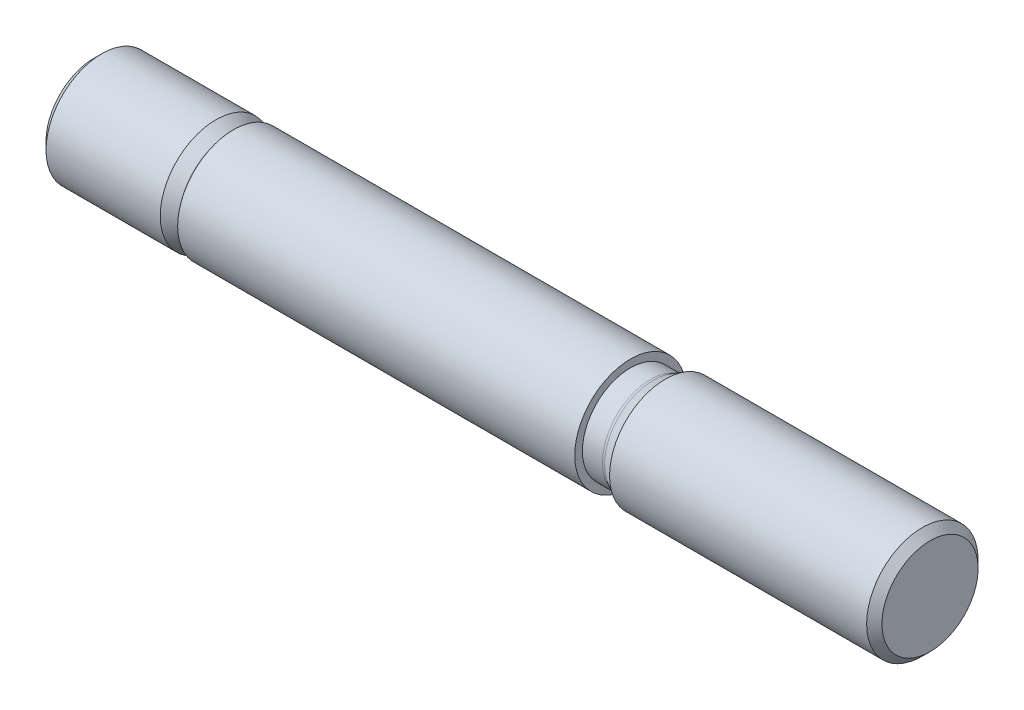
ISO-10303-21;
HEADER;
FILE_DESCRIPTION(('STEP AP214'),'2;1');
FILE_NAME('part.step','',(''),(''),'','','');
FILE_SCHEMA(('AUTOMOTIVE_DESIGN { 1 0 10303 214 1 1 1 1 }'));
ENDSEC;
DATA;
#1=APPLICATION_CONTEXT('core data for automotive mechanical design processes');
#2=APPLICATION_PROTOCOL_DEFINITION('international standard','automotive_design',2000,#1);
#3=PRODUCT_CONTEXT('',#1,'mechanical');
#4=PRODUCT('Part','Part','',(#3));
#5=PRODUCT_RELATED_PRODUCT_CATEGORY('part','',(#4));
#6=PRODUCT_DEFINITION_FORMATION('','',#4);
#7=PRODUCT_DEFINITION_CONTEXT('part definition',#1,'design');
#8=PRODUCT_DEFINITION('design','',#6,#7);
#9=PRODUCT_DEFINITION_SHAPE('','',#8);
#10=(LENGTH_UNIT() NAMED_UNIT(*) SI_UNIT(.MILLI.,.METRE.));
#11=(NAMED_UNIT(*) PLANE_ANGLE_UNIT() SI_UNIT($,.RADIAN.));
#12=(NAMED_UNIT(*) SI_UNIT($,.STERADIAN.) SOLID_ANGLE_UNIT());
#13=UNCERTAINTY_MEASURE_WITH_UNIT(LENGTH_MEASURE(1.E-05),#10,'distance_accuracy_value','');
#14=(GEOMETRIC_REPRESENTATION_CONTEXT(3) GLOBAL_UNCERTAINTY_ASSIGNED_CONTEXT((#13)) GLOBAL_UNIT_ASSIGNED_CONTEXT((#10,
#11,#12)) REPRESENTATION_CONTEXT('',''));
#15=CARTESIAN_POINT('',(0.,0.,0.));
#16=DIRECTION('',(0.,0.,1.));
#17=DIRECTION('',(1.,0.,0.));
#18=AXIS2_PLACEMENT_3D('',#15,#16,#17);
#19=CARTESIAN_POINT('',(0.,6.9,0.));
#20=DIRECTION('',(1.,0.,0.));
#21=DIRECTION('',(0.,0.,-1.));
#22=AXIS2_PLACEMENT_3D('',#19,#20,#21);
#23=PLANE('',#22);
#24=CARTESIAN_POINT('',(0.,0.,0.));
#25=DIRECTION('',(-1.,0.,0.));
#26=DIRECTION('',(0.,0.,1.));
#27=AXIS2_PLACEMENT_3D('',#24,#25,#26);
#28=CIRCLE('',#27,6.9);
#29=CARTESIAN_POINT('',(0.,0.,6.9));
#30=VERTEX_POINT('',#29);
#31=EDGE_CURVE('E85',#30,#30,#28,.T.);
#32=ORIENTED_EDGE('',*,*,#31,.T.);
#33=EDGE_LOOP('',(#32));
#34=FACE_BOUND('',#33,.T.);
#35=ADVANCED_FACE('F40',(#34),#23,.F.);
#36=CARTESIAN_POINT('',(120.,6.9,0.));
#37=DIRECTION('',(1.,0.,0.));
#38=DIRECTION('',(0.,0.,-1.));
#39=AXIS2_PLACEMENT_3D('',#36,#37,#38);
#40=PLANE('',#39);
#41=CARTESIAN_POINT('',(120.,0.,0.));
#42=DIRECTION('',(-1.,0.,0.));
#43=DIRECTION('',(0.,0.,1.));
#44=AXIS2_PLACEMENT_3D('',#41,#42,#43);
#45=CIRCLE('',#44,6.9);
#46=CARTESIAN_POINT('',(120.,0.,6.9));
#47=VERTEX_POINT('',#46);
#48=EDGE_CURVE('E10',#47,#47,#45,.T.);
#49=ORIENTED_EDGE('',*,*,#48,.F.);
#50=EDGE_LOOP('',(#49));
#51=FACE_BOUND('',#50,.T.);
#52=ADVANCED_FACE('F136',(#51),#40,.T.);
#53=CARTESIAN_POINT('',(118.9,0.,0.));
#54=DIRECTION('',(-1.,0.,0.));
#55=DIRECTION('',(0.,0.,1.));
#56=AXIS2_PLACEMENT_3D('',#53,#54,#55);
#57=CONICAL_SURFACE('',#56,8.,0.785398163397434);
#58=ORIENTED_EDGE('',*,*,#48,.T.);
#59=EDGE_LOOP('',(#58));
#60=FACE_BOUND('',#59,.T.);
#61=CARTESIAN_POINT('',(118.9,0.,0.));
#62=DIRECTION('',(-1.,0.,0.));
#63=DIRECTION('',(0.,0.,1.));
#64=AXIS2_PLACEMENT_3D('',#61,#62,#63);
#65=CIRCLE('',#64,8.);
#66=CARTESIAN_POINT('',(118.9,0.,8.));
#67=VERTEX_POINT('',#66);
#68=EDGE_CURVE('E43',#67,#67,#65,.T.);
#69=ORIENTED_EDGE('',*,*,#68,.F.);
#70=EDGE_LOOP('',(#69));
#71=FACE_BOUND('',#70,.T.);
#72=ADVANCED_FACE('F139',(#60,#71),#57,.T.);
#73=CARTESIAN_POINT('',(-3.175,0.,0.));
#74=DIRECTION('',(-1.,0.,0.));
#75=DIRECTION('',(0.,0.,1.));
#76=AXIS2_PLACEMENT_3D('',#73,#74,#75);
#77=CYLINDRICAL_SURFACE('',#76,8.);
#78=ORIENTED_EDGE('',*,*,#68,.T.);
#79=EDGE_LOOP('',(#78));
#80=FACE_BOUND('',#79,.T.);
#81=CARTESIAN_POINT('',(82.,0.,0.));
#82=DIRECTION('',(-1.,0.,0.));
#83=DIRECTION('',(0.,0.,1.));
#84=AXIS2_PLACEMENT_3D('',#81,#82,#83);
#85=CIRCLE('',#84,8.);
#86=CARTESIAN_POINT('',(82.,0.,8.));
#87=VERTEX_POINT('',#86);
#88=EDGE_CURVE('E50',#87,#87,#85,.T.);
#89=ORIENTED_EDGE('',*,*,#88,.F.);
#90=EDGE_LOOP('',(#89));
#91=FACE_BOUND('',#90,.T.);
#92=ADVANCED_FACE('F143',(#80,#91),#77,.T.);
#93=CARTESIAN_POINT('',(80.2803847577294,0.,0.));
#94=DIRECTION('',(1.,0.,0.));
#95=DIRECTION('',(0.,0.,-1.));
#96=AXIS2_PLACEMENT_3D('',#93,#94,#95);
#97=CONICAL_SURFACE('',#96,7.00717967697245,0.523598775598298);
#98=ORIENTED_EDGE('',*,*,#88,.T.);
#99=EDGE_LOOP('',(#98));
#100=FACE_BOUND('',#99,.T.);
#101=CARTESIAN_POINT('',(80.2803847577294,0.,0.));
#102=DIRECTION('',(-1.,0.,0.));
#103=DIRECTION('',(0.,0.,1.));
#104=AXIS2_PLACEMENT_3D('',#101,#102,#103);
#105=CIRCLE('',#104,7.00717967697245);
#106=CARTESIAN_POINT('',(80.2803847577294,0.,7.00717967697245));
#107=VERTEX_POINT('',#106);
#108=EDGE_CURVE('E51',#107,#107,#105,.T.);
#109=ORIENTED_EDGE('',*,*,#108,.F.);
#110=EDGE_LOOP('',(#109));
#111=FACE_BOUND('',#110,.T.);
#112=ADVANCED_FACE('F147',(#100,#111),#97,.T.);
#113=CARTESIAN_POINT('',(79.8803847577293,0.,0.));
#114=DIRECTION('',(-1.,0.,0.));
#115=DIRECTION('',(0.,0.,1.));
#116=AXIS2_PLACEMENT_3D('',#113,#114,#115);
#117=TOROIDAL_SURFACE('',#116,7.7,0.800000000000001);
#118=ORIENTED_EDGE('',*,*,#108,.T.);
#119=EDGE_LOOP('',(#118));
#120=FACE_BOUND('',#119,.T.);
#121=CARTESIAN_POINT('',(79.8803847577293,0.,0.));
#122=DIRECTION('',(-1.,0.,0.));
#123=DIRECTION('',(0.,0.,1.));
#124=AXIS2_PLACEMENT_3D('',#121,#122,#123);
#125=CIRCLE('',#124,6.9);
#126=CARTESIAN_POINT('',(79.8803847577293,0.,6.9));
#127=VERTEX_POINT('',#126);
#128=EDGE_CURVE('E57',#127,#127,#125,.T.);
#129=ORIENTED_EDGE('',*,*,#128,.F.);
#130=EDGE_LOOP('',(#129));
#131=FACE_BOUND('',#130,.T.);
#132=ADVANCED_FACE('F153',(#120,#131),#117,.F.);
#133=CARTESIAN_POINT('',(-3.175,0.,0.));
#134=DIRECTION('',(-1.,0.,0.));
#135=DIRECTION('',(0.,0.,1.));
#136=AXIS2_PLACEMENT_3D('',#133,#134,#135);
#137=CYLINDRICAL_SURFACE('',#136,6.9);
#138=ORIENTED_EDGE('',*,*,#128,.T.);
#139=EDGE_LOOP('',(#138));
#140=FACE_BOUND('',#139,.T.);
#141=CARTESIAN_POINT('',(77.,0.,0.));
#142=DIRECTION('',(-1.,0.,0.));
#143=DIRECTION('',(0.,0.,1.));
#144=AXIS2_PLACEMENT_3D('',#141,#142,#143);
#145=CIRCLE('',#144,6.9);
#146=CARTESIAN_POINT('',(77.,0.,6.9));
#147=VERTEX_POINT('',#146);
#148=EDGE_CURVE('E56',#147,#147,#145,.T.);
#149=ORIENTED_EDGE('',*,*,#148,.F.);
#150=EDGE_LOOP('',(#149));
#151=FACE_BOUND('',#150,.T.);
#152=ADVANCED_FACE('F135',(#140,#151),#137,.T.);
#153=CARTESIAN_POINT('',(77.,8.,0.));
#154=DIRECTION('',(1.,0.,0.));
#155=DIRECTION('',(0.,0.,-1.));
#156=AXIS2_PLACEMENT_3D('',#153,#154,#155);
#157=PLANE('',#156);
#158=ORIENTED_EDGE('',*,*,#148,.T.);
#159=EDGE_LOOP('',(#158));
#160=FACE_BOUND('',#159,.T.);
#161=CARTESIAN_POINT('',(77.,0.,0.));
#162=DIRECTION('',(-1.,0.,0.));
#163=DIRECTION('',(0.,0.,1.));
#164=AXIS2_PLACEMENT_3D('',#161,#162,#163);
#165=CIRCLE('',#164,8.);
#166=CARTESIAN_POINT('',(77.,0.,8.));
#167=VERTEX_POINT('',#166);
#168=EDGE_CURVE('E61',#167,#167,#165,.T.);
#169=ORIENTED_EDGE('',*,*,#168,.F.);
#170=EDGE_LOOP('',(#169));
#171=FACE_BOUND('',#170,.T.);
#172=ADVANCED_FACE('F129',(#160,#171),#157,.T.);
#173=CARTESIAN_POINT('',(-3.175,0.,0.));
#174=DIRECTION('',(-1.,0.,0.));
#175=DIRECTION('',(0.,0.,1.));
#176=AXIS2_PLACEMENT_3D('',#173,#174,#175);
#177=CYLINDRICAL_SURFACE('',#176,8.);
#178=ORIENTED_EDGE('',*,*,#168,.T.);
#179=EDGE_LOOP('',(#178));
#180=FACE_BOUND('',#179,.T.);
#181=CARTESIAN_POINT('',(20.,0.,0.));
#182=DIRECTION('',(-1.,0.,0.));
#183=DIRECTION('',(0.,0.,1.));
#184=AXIS2_PLACEMENT_3D('',#181,#182,#183);
#185=CIRCLE('',#184,8.);
#186=CARTESIAN_POINT('',(20.,0.,8.));
#187=VERTEX_POINT('',#186);
#188=EDGE_CURVE('E62',#187,#187,#185,.T.);
#189=ORIENTED_EDGE('',*,*,#188,.F.);
#190=EDGE_LOOP('',(#189));
#191=FACE_BOUND('',#190,.T.);
#192=ADVANCED_FACE('F122',(#180,#191),#177,.T.);
#193=CARTESIAN_POINT('',(20.,8.,0.));
#194=DIRECTION('',(1.,0.,0.));
#195=DIRECTION('',(0.,0.,-1.));
#196=AXIS2_PLACEMENT_3D('',#193,#194,#195);
#197=PLANE('',#196);
#198=CARTESIAN_POINT('',(20.,0.,0.));
#199=DIRECTION('',(-1.,0.,0.));
#200=DIRECTION('',(0.,0.,1.));
#201=AXIS2_PLACEMENT_3D('',#198,#199,#200);
#202=CIRCLE('',#201,6.9);
#203=CARTESIAN_POINT('',(20.,0.,6.9));
#204=VERTEX_POINT('',#203);
#205=EDGE_CURVE('E68',#204,#204,#202,.T.);
#206=ORIENTED_EDGE('',*,*,#205,.F.);
#207=EDGE_LOOP('',(#206));
#208=FACE_BOUND('',#207,.T.);
#209=ORIENTED_EDGE('',*,*,#188,.T.);
#210=EDGE_LOOP('',(#209));
#211=FACE_BOUND('',#210,.T.);
#212=ADVANCED_FACE('F114',(#208,#211),#197,.F.);
#213=CARTESIAN_POINT('',(-3.175,0.,0.));
#214=DIRECTION('',(-1.,0.,0.));
#215=DIRECTION('',(0.,0.,1.));
#216=AXIS2_PLACEMENT_3D('',#213,#214,#215);
#217=CYLINDRICAL_SURFACE('',#216,6.9);
#218=CARTESIAN_POINT('',(19.6196152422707,0.,0.));
#219=DIRECTION('',(-1.,0.,0.));
#220=DIRECTION('',(0.,0.,1.));
#221=AXIS2_PLACEMENT_3D('',#218,#219,#220);
#222=CIRCLE('',#221,6.9);
#223=CARTESIAN_POINT('',(19.6196152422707,0.,6.9));
#224=VERTEX_POINT('',#223);
#225=EDGE_CURVE('E71',#224,#224,#222,.T.);
#226=ORIENTED_EDGE('',*,*,#225,.F.);
#227=EDGE_LOOP('',(#226));
#228=FACE_BOUND('',#227,.T.);
#229=ORIENTED_EDGE('',*,*,#205,.T.);
#230=EDGE_LOOP('',(#229));
#231=FACE_BOUND('',#230,.T.);
#232=ADVANCED_FACE('F107',(#228,#231),#217,.T.);
#233=CARTESIAN_POINT('',(19.6196152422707,0.,0.));
#234=DIRECTION('',(-1.,0.,0.));
#235=DIRECTION('',(0.,0.,1.));
#236=AXIS2_PLACEMENT_3D('',#233,#234,#235);
#237=TOROIDAL_SURFACE('',#236,7.7,0.8);
#238=CARTESIAN_POINT('',(19.2196152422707,0.,0.));
#239=DIRECTION('',(-1.,0.,0.));
#240=DIRECTION('',(0.,0.,1.));
#241=AXIS2_PLACEMENT_3D('',#238,#239,#240);
#242=CIRCLE('',#241,7.00717967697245);
#243=CARTESIAN_POINT('',(19.2196152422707,0.,7.00717967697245));
#244=VERTEX_POINT('',#243);
#245=EDGE_CURVE('E73',#244,#244,#242,.T.);
#246=ORIENTED_EDGE('',*,*,#245,.F.);
#247=EDGE_LOOP('',(#246));
#248=FACE_BOUND('',#247,.T.);
#249=ORIENTED_EDGE('',*,*,#225,.T.);
#250=EDGE_LOOP('',(#249));
#251=FACE_BOUND('',#250,.T.);
#252=ADVANCED_FACE('F101',(#248,#251),#237,.F.);
#253=CARTESIAN_POINT('',(19.2196152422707,0.,0.));
#254=DIRECTION('',(-1.,0.,0.));
#255=DIRECTION('',(0.,0.,1.));
#256=AXIS2_PLACEMENT_3D('',#253,#254,#255);
#257=CONICAL_SURFACE('',#256,7.00717967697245,0.523598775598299);
#258=CARTESIAN_POINT('',(17.5,0.,0.));
#259=DIRECTION('',(-1.,0.,0.));
#260=DIRECTION('',(0.,0.,1.));
#261=AXIS2_PLACEMENT_3D('',#258,#259,#260);
#262=CIRCLE('',#261,8.);
#263=CARTESIAN_POINT('',(17.5,0.,8.));
#264=VERTEX_POINT('',#263);
#265=EDGE_CURVE('E80',#264,#264,#262,.T.);
#266=ORIENTED_EDGE('',*,*,#265,.F.);
#267=EDGE_LOOP('',(#266));
#268=FACE_BOUND('',#267,.T.);
#269=ORIENTED_EDGE('',*,*,#245,.T.);
#270=EDGE_LOOP('',(#269));
#271=FACE_BOUND('',#270,.T.);
#272=ADVANCED_FACE('F97',(#268,#271),#257,.T.);
#273=CARTESIAN_POINT('',(-3.175,0.,0.));
#274=DIRECTION('',(-1.,0.,0.));
#275=DIRECTION('',(0.,0.,1.));
#276=AXIS2_PLACEMENT_3D('',#273,#274,#275);
#277=CYLINDRICAL_SURFACE('',#276,8.);
#278=CARTESIAN_POINT('',(1.09999999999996,0.,0.));
#279=DIRECTION('',(-1.,0.,0.));
#280=DIRECTION('',(0.,0.,1.));
#281=AXIS2_PLACEMENT_3D('',#278,#279,#280);
#282=CIRCLE('',#281,8.);
#283=CARTESIAN_POINT('',(1.09999999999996,0.,8.));
#284=VERTEX_POINT('',#283);
#285=EDGE_CURVE('E78',#284,#284,#282,.T.);
#286=ORIENTED_EDGE('',*,*,#285,.F.);
#287=EDGE_LOOP('',(#286));
#288=FACE_BOUND('',#287,.T.);
#289=ORIENTED_EDGE('',*,*,#265,.T.);
#290=EDGE_LOOP('',(#289));
#291=FACE_BOUND('',#290,.T.);
#292=ADVANCED_FACE('F91',(#288,#291),#277,.T.);
#293=CARTESIAN_POINT('',(1.09999999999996,0.,0.));
#294=DIRECTION('',(1.,0.,0.));
#295=DIRECTION('',(0.,0.,-1.));
#296=AXIS2_PLACEMENT_3D('',#293,#294,#295);
#297=CONICAL_SURFACE('',#296,8.,0.785398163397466);
#298=ORIENTED_EDGE('',*,*,#31,.F.);
#299=EDGE_LOOP('',(#298));
#300=FACE_BOUND('',#299,.T.);
#301=ORIENTED_EDGE('',*,*,#285,.T.);
#302=EDGE_LOOP('',(#301));
#303=FACE_BOUND('',#302,.T.);
#304=ADVANCED_FACE('F88',(#300,#303),#297,.T.);
#305=CLOSED_SHELL('',(#35,#52,#72,#92,#112,#132,#152,#172,#192,#212,#232,#252,#272,#292,#304));
#306=MANIFOLD_SOLID_BREP('B2',#305);
#307=ADVANCED_BREP_SHAPE_REPRESENTATION('',(#18,#306),#14);
#308=SHAPE_DEFINITION_REPRESENTATION(#9,#307);
ENDSEC;
END-ISO-10303-21;
